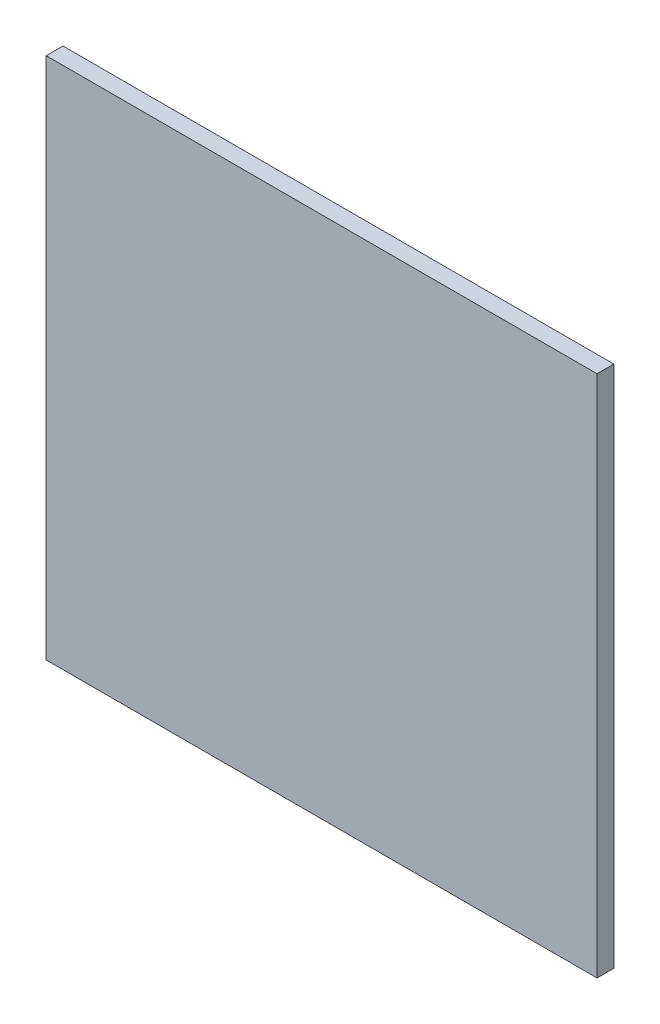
ISO-10303-21;
HEADER;
FILE_DESCRIPTION(('STEP AP214'),'2;1');
FILE_NAME('part.step','',(''),(''),'','','');
FILE_SCHEMA(('AUTOMOTIVE_DESIGN { 1 0 10303 214 1 1 1 1 }'));
ENDSEC;
DATA;
#1=APPLICATION_CONTEXT('core data for automotive mechanical design processes');
#2=APPLICATION_PROTOCOL_DEFINITION('international standard','automotive_design',2000,#1);
#3=PRODUCT_CONTEXT('',#1,'mechanical');
#4=PRODUCT('Part','Part','',(#3));
#5=PRODUCT_RELATED_PRODUCT_CATEGORY('part','',(#4));
#6=PRODUCT_DEFINITION_FORMATION('','',#4);
#7=PRODUCT_DEFINITION_CONTEXT('part definition',#1,'design');
#8=PRODUCT_DEFINITION('design','',#6,#7);
#9=PRODUCT_DEFINITION_SHAPE('','',#8);
#10=(LENGTH_UNIT() NAMED_UNIT(*) SI_UNIT(.MILLI.,.METRE.));
#11=(NAMED_UNIT(*) PLANE_ANGLE_UNIT() SI_UNIT($,.RADIAN.));
#12=(NAMED_UNIT(*) SI_UNIT($,.STERADIAN.) SOLID_ANGLE_UNIT());
#13=UNCERTAINTY_MEASURE_WITH_UNIT(LENGTH_MEASURE(1.E-05),#10,'distance_accuracy_value','');
#14=(GEOMETRIC_REPRESENTATION_CONTEXT(3) GLOBAL_UNCERTAINTY_ASSIGNED_CONTEXT((#13)) GLOBAL_UNIT_ASSIGNED_CONTEXT((#10,
#11,#12)) REPRESENTATION_CONTEXT('',''));
#15=CARTESIAN_POINT('',(0.,0.,0.));
#16=DIRECTION('',(0.,0.,1.));
#17=DIRECTION('',(1.,0.,0.));
#18=AXIS2_PLACEMENT_3D('',#15,#16,#17);
#19=CARTESIAN_POINT('',(14.9,15.175,-0.03048));
#20=DIRECTION('',(0.,-1.,0.));
#21=DIRECTION('',(0.,0.,-1.));
#22=AXIS2_PLACEMENT_3D('',#19,#20,#21);
#23=PLANE('',#22);
#24=DIRECTION('',(1.,0.,0.));
#25=VECTOR('',#24,1.);
#26=CARTESIAN_POINT('',(15.4,15.175,0.));
#27=LINE('',#26,#25);
#28=CARTESIAN_POINT('',(14.9,15.175,0.));
#29=VERTEX_POINT('',#28);
#30=CARTESIAN_POINT('',(15.9,15.175,0.));
#31=VERTEX_POINT('',#30);
#32=EDGE_CURVE('E74',#29,#31,#27,.T.);
#33=ORIENTED_EDGE('',*,*,#32,.T.);
#34=DIRECTION('',(0.,0.,-1.));
#35=VECTOR('',#34,1.);
#36=CARTESIAN_POINT('',(15.9,15.175,-0.01524));
#37=LINE('',#36,#35);
#38=CARTESIAN_POINT('',(15.9,15.175,-0.03048));
#39=VERTEX_POINT('',#38);
#40=EDGE_CURVE('E112',#31,#39,#37,.T.);
#41=ORIENTED_EDGE('',*,*,#40,.T.);
#42=DIRECTION('',(1.,0.,0.));
#43=VECTOR('',#42,1.);
#44=CARTESIAN_POINT('',(14.9,15.175,-0.03048));
#45=LINE('',#44,#43);
#46=CARTESIAN_POINT('',(14.9,15.175,-0.03048));
#47=VERTEX_POINT('',#46);
#48=EDGE_CURVE('E76',#47,#39,#45,.T.);
#49=ORIENTED_EDGE('',*,*,#48,.F.);
#50=DIRECTION('',(0.,0.,-1.));
#51=VECTOR('',#50,1.);
#52=CARTESIAN_POINT('',(14.9,15.175,-0.01524));
#53=LINE('',#52,#51);
#54=EDGE_CURVE('E11',#29,#47,#53,.T.);
#55=ORIENTED_EDGE('',*,*,#54,.F.);
#56=EDGE_LOOP('',(#33,#41,#49,#55));
#57=FACE_BOUND('',#56,.T.);
#58=ADVANCED_FACE('F17',(#57),#23,.F.);
#59=CARTESIAN_POINT('',(14.9,14.225,-0.03048));
#60=DIRECTION('',(1.,0.,0.));
#61=DIRECTION('',(0.,1.,0.));
#62=AXIS2_PLACEMENT_3D('',#59,#60,#61);
#63=PLANE('',#62);
#64=DIRECTION('',(0.,1.,0.));
#65=VECTOR('',#64,1.);
#66=CARTESIAN_POINT('',(14.9,14.7,0.));
#67=LINE('',#66,#65);
#68=CARTESIAN_POINT('',(14.9,14.225,0.));
#69=VERTEX_POINT('',#68);
#70=EDGE_CURVE('E80',#69,#29,#67,.T.);
#71=ORIENTED_EDGE('',*,*,#70,.T.);
#72=ORIENTED_EDGE('',*,*,#54,.T.);
#73=DIRECTION('',(0.,1.,0.));
#74=VECTOR('',#73,1.);
#75=CARTESIAN_POINT('',(14.9,14.225,-0.03048));
#76=LINE('',#75,#74);
#77=CARTESIAN_POINT('',(14.9,14.225,-0.03048));
#78=VERTEX_POINT('',#77);
#79=EDGE_CURVE('E100',#78,#47,#76,.T.);
#80=ORIENTED_EDGE('',*,*,#79,.F.);
#81=DIRECTION('',(0.,0.,-1.));
#82=VECTOR('',#81,1.);
#83=CARTESIAN_POINT('',(14.9,14.225,-0.01524));
#84=LINE('',#83,#82);
#85=EDGE_CURVE('E26',#69,#78,#84,.T.);
#86=ORIENTED_EDGE('',*,*,#85,.F.);
#87=EDGE_LOOP('',(#71,#72,#80,#86));
#88=FACE_BOUND('',#87,.T.);
#89=ADVANCED_FACE('F81',(#88),#63,.F.);
#90=CARTESIAN_POINT('',(15.9,14.225,-0.03048));
#91=DIRECTION('',(0.,1.,0.));
#92=DIRECTION('',(1.,0.,0.));
#93=AXIS2_PLACEMENT_3D('',#90,#91,#92);
#94=PLANE('',#93);
#95=DIRECTION('',(-1.,0.,0.));
#96=VECTOR('',#95,1.);
#97=CARTESIAN_POINT('',(15.4,14.225,0.));
#98=LINE('',#97,#96);
#99=CARTESIAN_POINT('',(15.9,14.225,0.));
#100=VERTEX_POINT('',#99);
#101=EDGE_CURVE('E85',#100,#69,#98,.T.);
#102=ORIENTED_EDGE('',*,*,#101,.T.);
#103=ORIENTED_EDGE('',*,*,#85,.T.);
#104=DIRECTION('',(-1.,0.,0.));
#105=VECTOR('',#104,1.);
#106=CARTESIAN_POINT('',(15.9,14.225,-0.03048));
#107=LINE('',#106,#105);
#108=CARTESIAN_POINT('',(15.9,14.225,-0.03048));
#109=VERTEX_POINT('',#108);
#110=EDGE_CURVE('E98',#109,#78,#107,.T.);
#111=ORIENTED_EDGE('',*,*,#110,.F.);
#112=DIRECTION('',(0.,0.,-1.));
#113=VECTOR('',#112,1.);
#114=CARTESIAN_POINT('',(15.9,14.225,-0.01524));
#115=LINE('',#114,#113);
#116=EDGE_CURVE('E47',#100,#109,#115,.T.);
#117=ORIENTED_EDGE('',*,*,#116,.F.);
#118=EDGE_LOOP('',(#102,#103,#111,#117));
#119=FACE_BOUND('',#118,.T.);
#120=ADVANCED_FACE('F19',(#119),#94,.F.);
#121=CARTESIAN_POINT('',(15.9,15.175,-0.03048));
#122=DIRECTION('',(-1.,0.,0.));
#123=DIRECTION('',(0.,0.,1.));
#124=AXIS2_PLACEMENT_3D('',#121,#122,#123);
#125=PLANE('',#124);
#126=DIRECTION('',(0.,-1.,0.));
#127=VECTOR('',#126,1.);
#128=CARTESIAN_POINT('',(15.9,14.7,0.));
#129=LINE('',#128,#127);
#130=EDGE_CURVE('E89',#31,#100,#129,.T.);
#131=ORIENTED_EDGE('',*,*,#130,.T.);
#132=ORIENTED_EDGE('',*,*,#116,.T.);
#133=DIRECTION('',(0.,-1.,0.));
#134=VECTOR('',#133,1.);
#135=CARTESIAN_POINT('',(15.9,15.175,-0.03048));
#136=LINE('',#135,#134);
#137=EDGE_CURVE('E97',#39,#109,#136,.T.);
#138=ORIENTED_EDGE('',*,*,#137,.F.);
#139=ORIENTED_EDGE('',*,*,#40,.F.);
#140=EDGE_LOOP('',(#131,#132,#138,#139));
#141=FACE_BOUND('',#140,.T.);
#142=ADVANCED_FACE('F143',(#141),#125,.F.);
#143=CARTESIAN_POINT('',(15.4,14.7,-0.03048));
#144=DIRECTION('',(0.,0.,1.));
#145=DIRECTION('',(1.,0.,0.));
#146=AXIS2_PLACEMENT_3D('',#143,#144,#145);
#147=PLANE('',#146);
#148=ORIENTED_EDGE('',*,*,#48,.T.);
#149=ORIENTED_EDGE('',*,*,#137,.T.);
#150=ORIENTED_EDGE('',*,*,#110,.T.);
#151=ORIENTED_EDGE('',*,*,#79,.T.);
#152=EDGE_LOOP('',(#148,#149,#150,#151));
#153=FACE_BOUND('',#152,.T.);
#154=ADVANCED_FACE('F125',(#153),#147,.F.);
#155=CARTESIAN_POINT('',(15.4,14.7,0.));
#156=DIRECTION('',(0.,0.,1.));
#157=DIRECTION('',(1.,0.,0.));
#158=AXIS2_PLACEMENT_3D('',#155,#156,#157);
#159=PLANE('',#158);
#160=ORIENTED_EDGE('',*,*,#32,.F.);
#161=ORIENTED_EDGE('',*,*,#70,.F.);
#162=ORIENTED_EDGE('',*,*,#101,.F.);
#163=ORIENTED_EDGE('',*,*,#130,.F.);
#164=EDGE_LOOP('',(#160,#161,#162,#163));
#165=FACE_BOUND('',#164,.T.);
#166=ADVANCED_FACE('F88',(#165),#159,.T.);
#167=CLOSED_SHELL('',(#58,#89,#120,#142,#154,#166));
#168=MANIFOLD_SOLID_BREP('B1',#167);
#169=ADVANCED_BREP_SHAPE_REPRESENTATION('',(#18,#168),#14);
#170=SHAPE_DEFINITION_REPRESENTATION(#9,#169);
ENDSEC;
END-ISO-10303-21;
